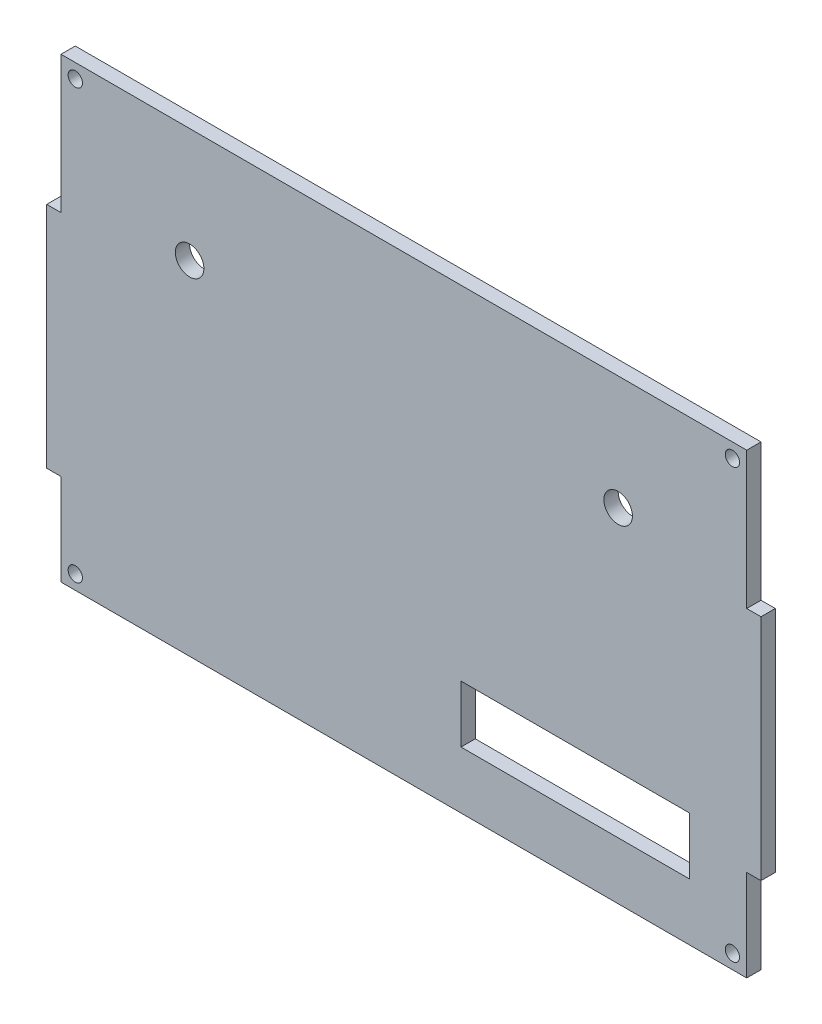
ISO-10303-21;
HEADER;
FILE_DESCRIPTION(('STEP AP214'),'2;1');
FILE_NAME('part.step','',(''),(''),'','','');
FILE_SCHEMA(('AUTOMOTIVE_DESIGN { 1 0 10303 214 1 1 1 1 }'));
ENDSEC;
DATA;
#1=APPLICATION_CONTEXT('core data for automotive mechanical design processes');
#2=APPLICATION_PROTOCOL_DEFINITION('international standard','automotive_design',2000,#1);
#3=PRODUCT_CONTEXT('',#1,'mechanical');
#4=PRODUCT('Part','Part','',(#3));
#5=PRODUCT_RELATED_PRODUCT_CATEGORY('part','',(#4));
#6=PRODUCT_DEFINITION_FORMATION('','',#4);
#7=PRODUCT_DEFINITION_CONTEXT('part definition',#1,'design');
#8=PRODUCT_DEFINITION('design','',#6,#7);
#9=PRODUCT_DEFINITION_SHAPE('','',#8);
#10=(LENGTH_UNIT() NAMED_UNIT(*) SI_UNIT(.MILLI.,.METRE.));
#11=(NAMED_UNIT(*) PLANE_ANGLE_UNIT() SI_UNIT($,.RADIAN.));
#12=(NAMED_UNIT(*) SI_UNIT($,.STERADIAN.) SOLID_ANGLE_UNIT());
#13=UNCERTAINTY_MEASURE_WITH_UNIT(LENGTH_MEASURE(1.E-05),#10,'distance_accuracy_value','');
#14=(GEOMETRIC_REPRESENTATION_CONTEXT(3) GLOBAL_UNCERTAINTY_ASSIGNED_CONTEXT((#13)) GLOBAL_UNIT_ASSIGNED_CONTEXT((#10,
#11,#12)) REPRESENTATION_CONTEXT('',''));
#15=CARTESIAN_POINT('',(0.,0.,0.));
#16=DIRECTION('',(0.,0.,1.));
#17=DIRECTION('',(1.,0.,0.));
#18=AXIS2_PLACEMENT_3D('',#15,#16,#17);
#19=CARTESIAN_POINT('',(-28.1520692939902,-11.4363190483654,3.175));
#20=DIRECTION('',(0.,0.,-1.));
#21=DIRECTION('',(-1.,0.,0.));
#22=AXIS2_PLACEMENT_3D('',#19,#20,#21);
#23=PLANE('',#22);
#24=CARTESIAN_POINT('',(0.422930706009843,-6.35631904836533,3.175));
#25=DIRECTION('',(0.,0.,1.));
#26=DIRECTION('',(1.,0.,0.));
#27=AXIS2_PLACEMENT_3D('',#24,#25,#26);
#28=CIRCLE('',#27,3.175);
#29=CARTESIAN_POINT('',(3.59793070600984,-6.35631904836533,3.175));
#30=VERTEX_POINT('',#29);
#31=EDGE_CURVE('E546',#30,#30,#28,.T.);
#32=ORIENTED_EDGE('',*,*,#31,.F.);
#33=EDGE_LOOP('',(#32));
#34=FACE_BOUND('',#33,.T.);
#35=CARTESIAN_POINT('',(121.07293070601,15.8686809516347,3.175));
#36=DIRECTION('',(0.,0.,1.));
#37=DIRECTION('',(1.,0.,0.));
#38=AXIS2_PLACEMENT_3D('',#35,#36,#37);
#39=CIRCLE('',#38,1.5875);
#40=CARTESIAN_POINT('',(122.66043070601,15.8686809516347,3.175));
#41=VERTEX_POINT('',#40);
#42=EDGE_CURVE('E558',#41,#41,#39,.T.);
#43=ORIENTED_EDGE('',*,*,#42,.F.);
#44=EDGE_LOOP('',(#43));
#45=FACE_BOUND('',#44,.T.);
#46=CARTESIAN_POINT('',(-24.9770692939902,-79.3813190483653,3.175));
#47=DIRECTION('',(0.,0.,1.));
#48=DIRECTION('',(1.,0.,0.));
#49=AXIS2_PLACEMENT_3D('',#46,#47,#48);
#50=CIRCLE('',#49,1.5875);
#51=CARTESIAN_POINT('',(-23.3895692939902,-79.3813190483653,3.175));
#52=VERTEX_POINT('',#51);
#53=EDGE_CURVE('E175',#52,#52,#50,.T.);
#54=ORIENTED_EDGE('',*,*,#53,.F.);
#55=EDGE_LOOP('',(#54));
#56=FACE_BOUND('',#55,.T.);
#57=DIRECTION('',(0.,-1.,0.));
#58=VECTOR('',#57,1.);
#59=CARTESIAN_POINT('',(-28.1520692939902,19.0436809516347,3.175));
#60=LINE('',#59,#58);
#61=CARTESIAN_POINT('',(-28.1520692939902,19.0436809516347,3.175));
#62=VERTEX_POINT('',#61);
#63=CARTESIAN_POINT('',(-28.1520692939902,-11.4363190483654,3.175));
#64=VERTEX_POINT('',#63);
#65=EDGE_CURVE('E185',#62,#64,#60,.T.);
#66=ORIENTED_EDGE('',*,*,#65,.T.);
#67=DIRECTION('',(-1.,0.,0.));
#68=VECTOR('',#67,1.);
#69=CARTESIAN_POINT('',(-28.1520692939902,-11.4363190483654,3.175));
#70=LINE('',#69,#68);
#71=CARTESIAN_POINT('',(-31.3270692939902,-11.4363190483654,3.175));
#72=VERTEX_POINT('',#71);
#73=EDGE_CURVE('E188',#64,#72,#70,.T.);
#74=ORIENTED_EDGE('',*,*,#73,.T.);
#75=DIRECTION('',(0.,-1.,0.));
#76=VECTOR('',#75,1.);
#77=CARTESIAN_POINT('',(-31.3270692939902,-11.4363190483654,3.175));
#78=LINE('',#77,#76);
#79=CARTESIAN_POINT('',(-31.3270692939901,-62.2363190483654,3.175));
#80=VERTEX_POINT('',#79);
#81=EDGE_CURVE('E191',#72,#80,#78,.T.);
#82=ORIENTED_EDGE('',*,*,#81,.T.);
#83=DIRECTION('',(1.,0.,0.));
#84=VECTOR('',#83,1.);
#85=CARTESIAN_POINT('',(-28.1520692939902,-62.2363190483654,3.175));
#86=LINE('',#85,#84);
#87=CARTESIAN_POINT('',(-28.1520692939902,-62.2363190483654,3.175));
#88=VERTEX_POINT('',#87);
#89=EDGE_CURVE('E193',#80,#88,#86,.T.);
#90=ORIENTED_EDGE('',*,*,#89,.T.);
#91=DIRECTION('',(0.,-1.,0.));
#92=VECTOR('',#91,1.);
#93=CARTESIAN_POINT('',(-28.1520692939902,-62.2363190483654,3.175));
#94=LINE('',#93,#92);
#95=CARTESIAN_POINT('',(-28.1520692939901,-82.5563190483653,3.175));
#96=VERTEX_POINT('',#95);
#97=EDGE_CURVE('E195',#88,#96,#94,.T.);
#98=ORIENTED_EDGE('',*,*,#97,.T.);
#99=DIRECTION('',(1.,0.,0.));
#100=VECTOR('',#99,1.);
#101=CARTESIAN_POINT('',(-28.1520692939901,-82.5563190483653,3.175));
#102=LINE('',#101,#100);
#103=CARTESIAN_POINT('',(124.24793070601,-82.5563190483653,3.175));
#104=VERTEX_POINT('',#103);
#105=EDGE_CURVE('E197',#96,#104,#102,.T.);
#106=ORIENTED_EDGE('',*,*,#105,.T.);
#107=DIRECTION('',(0.,1.,0.));
#108=VECTOR('',#107,1.);
#109=CARTESIAN_POINT('',(124.24793070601,-62.2363190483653,3.175));
#110=LINE('',#109,#108);
#111=CARTESIAN_POINT('',(124.24793070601,-62.2363190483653,3.175));
#112=VERTEX_POINT('',#111);
#113=EDGE_CURVE('E199',#104,#112,#110,.T.);
#114=ORIENTED_EDGE('',*,*,#113,.T.);
#115=DIRECTION('',(1.,0.,0.));
#116=VECTOR('',#115,1.);
#117=CARTESIAN_POINT('',(124.24793070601,-62.2363190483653,3.175));
#118=LINE('',#117,#116);
#119=CARTESIAN_POINT('',(127.42293070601,-62.2363190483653,3.175));
#120=VERTEX_POINT('',#119);
#121=EDGE_CURVE('E201',#112,#120,#118,.T.);
#122=ORIENTED_EDGE('',*,*,#121,.T.);
#123=DIRECTION('',(0.,1.,0.));
#124=VECTOR('',#123,1.);
#125=CARTESIAN_POINT('',(127.42293070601,-11.4363190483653,3.175));
#126=LINE('',#125,#124);
#127=CARTESIAN_POINT('',(127.42293070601,-11.4363190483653,3.175));
#128=VERTEX_POINT('',#127);
#129=EDGE_CURVE('E203',#120,#128,#126,.T.);
#130=ORIENTED_EDGE('',*,*,#129,.T.);
#131=DIRECTION('',(-1.,0.,0.));
#132=VECTOR('',#131,1.);
#133=CARTESIAN_POINT('',(124.24793070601,-11.4363190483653,3.175));
#134=LINE('',#133,#132);
#135=CARTESIAN_POINT('',(124.24793070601,-11.4363190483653,3.175));
#136=VERTEX_POINT('',#135);
#137=EDGE_CURVE('E205',#128,#136,#134,.T.);
#138=ORIENTED_EDGE('',*,*,#137,.T.);
#139=DIRECTION('',(0.,1.,0.));
#140=VECTOR('',#139,1.);
#141=CARTESIAN_POINT('',(124.24793070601,19.0436809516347,3.175));
#142=LINE('',#141,#140);
#143=CARTESIAN_POINT('',(124.24793070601,19.0436809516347,3.175));
#144=VERTEX_POINT('',#143);
#145=EDGE_CURVE('E207',#136,#144,#142,.T.);
#146=ORIENTED_EDGE('',*,*,#145,.T.);
#147=DIRECTION('',(-1.,0.,0.));
#148=VECTOR('',#147,1.);
#149=CARTESIAN_POINT('',(-28.1520692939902,19.0436809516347,3.175));
#150=LINE('',#149,#148);
#151=EDGE_CURVE('E209',#144,#62,#150,.T.);
#152=ORIENTED_EDGE('',*,*,#151,.T.);
#153=EDGE_LOOP('',(#66,#74,#82,#90,#98,#106,#114,#122,#130,#138,#146,#152));
#154=FACE_BOUND('',#153,.T.);
#155=DIRECTION('',(0.,-1.,0.));
#156=VECTOR('',#155,1.);
#157=CARTESIAN_POINT('',(60.7479307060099,-57.1563190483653,3.175));
#158=LINE('',#157,#156);
#159=CARTESIAN_POINT('',(60.7479307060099,-57.1563190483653,3.175));
#160=VERTEX_POINT('',#159);
#161=CARTESIAN_POINT('',(60.7479307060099,-69.8563190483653,3.175));
#162=VERTEX_POINT('',#161);
#163=EDGE_CURVE('E146',#160,#162,#158,.T.);
#164=ORIENTED_EDGE('',*,*,#163,.F.);
#165=DIRECTION('',(-1.,0.,0.));
#166=VECTOR('',#165,1.);
#167=CARTESIAN_POINT('',(60.7479307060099,-57.1563190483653,3.175));
#168=LINE('',#167,#166);
#169=CARTESIAN_POINT('',(111.54793070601,-57.1563190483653,3.175));
#170=VERTEX_POINT('',#169);
#171=EDGE_CURVE('E169',#170,#160,#168,.T.);
#172=ORIENTED_EDGE('',*,*,#171,.F.);
#173=DIRECTION('',(0.,1.,0.));
#174=VECTOR('',#173,1.);
#175=CARTESIAN_POINT('',(111.54793070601,-57.1563190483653,3.175));
#176=LINE('',#175,#174);
#177=CARTESIAN_POINT('',(111.54793070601,-69.8563190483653,3.175));
#178=VERTEX_POINT('',#177);
#179=EDGE_CURVE('E167',#178,#170,#176,.T.);
#180=ORIENTED_EDGE('',*,*,#179,.F.);
#181=DIRECTION('',(1.,0.,0.));
#182=VECTOR('',#181,1.);
#183=CARTESIAN_POINT('',(60.7479307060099,-69.8563190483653,3.175));
#184=LINE('',#183,#182);
#185=EDGE_CURVE('E154',#162,#178,#184,.T.);
#186=ORIENTED_EDGE('',*,*,#185,.F.);
#187=EDGE_LOOP('',(#164,#172,#180,#186));
#188=FACE_BOUND('',#187,.T.);
#189=CARTESIAN_POINT('',(-24.9770692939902,15.8686809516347,3.175));
#190=DIRECTION('',(0.,0.,1.));
#191=DIRECTION('',(1.,0.,0.));
#192=AXIS2_PLACEMENT_3D('',#189,#190,#191);
#193=CIRCLE('',#192,1.5875);
#194=CARTESIAN_POINT('',(-23.3895692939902,15.8686809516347,3.175));
#195=VERTEX_POINT('',#194);
#196=EDGE_CURVE('E564',#195,#195,#193,.T.);
#197=ORIENTED_EDGE('',*,*,#196,.F.);
#198=EDGE_LOOP('',(#197));
#199=FACE_BOUND('',#198,.T.);
#200=CARTESIAN_POINT('',(121.07293070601,-79.3813190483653,3.175));
#201=DIRECTION('',(0.,0.,1.));
#202=DIRECTION('',(1.,0.,0.));
#203=AXIS2_PLACEMENT_3D('',#200,#201,#202);
#204=CIRCLE('',#203,1.5875);
#205=CARTESIAN_POINT('',(122.66043070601,-79.3813190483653,3.175));
#206=VERTEX_POINT('',#205);
#207=EDGE_CURVE('E552',#206,#206,#204,.T.);
#208=ORIENTED_EDGE('',*,*,#207,.F.);
#209=EDGE_LOOP('',(#208));
#210=FACE_BOUND('',#209,.T.);
#211=CARTESIAN_POINT('',(95.6729307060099,-6.35631904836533,3.175));
#212=DIRECTION('',(0.,0.,1.));
#213=DIRECTION('',(1.,0.,0.));
#214=AXIS2_PLACEMENT_3D('',#211,#212,#213);
#215=CIRCLE('',#214,3.175);
#216=CARTESIAN_POINT('',(98.8479307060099,-6.35631904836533,3.175));
#217=VERTEX_POINT('',#216);
#218=EDGE_CURVE('E537',#217,#217,#215,.T.);
#219=ORIENTED_EDGE('',*,*,#218,.F.);
#220=EDGE_LOOP('',(#219));
#221=FACE_BOUND('',#220,.T.);
#222=ADVANCED_FACE('F33',(#34,#45,#56,#154,#188,#199,#210,#221),#23,.F.);
#223=CARTESIAN_POINT('',(-28.1520692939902,-11.4363190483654,0.));
#224=DIRECTION('',(0.,0.,-1.));
#225=DIRECTION('',(-1.,0.,0.));
#226=AXIS2_PLACEMENT_3D('',#223,#224,#225);
#227=PLANE('',#226);
#228=CARTESIAN_POINT('',(0.422930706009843,-6.35631904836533,0.));
#229=DIRECTION('',(0.,0.,1.));
#230=DIRECTION('',(1.,0.,0.));
#231=AXIS2_PLACEMENT_3D('',#228,#229,#230);
#232=CIRCLE('',#231,3.175);
#233=CARTESIAN_POINT('',(3.59793070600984,-6.35631904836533,0.));
#234=VERTEX_POINT('',#233);
#235=EDGE_CURVE('E543',#234,#234,#232,.T.);
#236=ORIENTED_EDGE('',*,*,#235,.T.);
#237=EDGE_LOOP('',(#236));
#238=FACE_BOUND('',#237,.T.);
#239=CARTESIAN_POINT('',(121.07293070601,15.8686809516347,0.));
#240=DIRECTION('',(0.,0.,1.));
#241=DIRECTION('',(1.,0.,0.));
#242=AXIS2_PLACEMENT_3D('',#239,#240,#241);
#243=CIRCLE('',#242,1.5875);
#244=CARTESIAN_POINT('',(122.66043070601,15.8686809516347,0.));
#245=VERTEX_POINT('',#244);
#246=EDGE_CURVE('E555',#245,#245,#243,.T.);
#247=ORIENTED_EDGE('',*,*,#246,.T.);
#248=EDGE_LOOP('',(#247));
#249=FACE_BOUND('',#248,.T.);
#250=CARTESIAN_POINT('',(-24.9770692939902,-79.3813190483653,0.));
#251=DIRECTION('',(0.,0.,1.));
#252=DIRECTION('',(1.,0.,0.));
#253=AXIS2_PLACEMENT_3D('',#250,#251,#252);
#254=CIRCLE('',#253,1.5875);
#255=CARTESIAN_POINT('',(-23.3895692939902,-79.3813190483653,0.));
#256=VERTEX_POINT('',#255);
#257=EDGE_CURVE('E567',#256,#256,#254,.T.);
#258=ORIENTED_EDGE('',*,*,#257,.T.);
#259=EDGE_LOOP('',(#258));
#260=FACE_BOUND('',#259,.T.);
#261=DIRECTION('',(0.,-1.,0.));
#262=VECTOR('',#261,1.);
#263=CARTESIAN_POINT('',(-28.1520692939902,19.0436809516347,0.));
#264=LINE('',#263,#262);
#265=CARTESIAN_POINT('',(-28.1520692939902,19.0436809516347,0.));
#266=VERTEX_POINT('',#265);
#267=CARTESIAN_POINT('',(-28.1520692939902,-11.4363190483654,0.));
#268=VERTEX_POINT('',#267);
#269=EDGE_CURVE('E162',#266,#268,#264,.T.);
#270=ORIENTED_EDGE('',*,*,#269,.F.);
#271=DIRECTION('',(-1.,0.,0.));
#272=VECTOR('',#271,1.);
#273=CARTESIAN_POINT('',(-28.1520692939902,19.0436809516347,0.));
#274=LINE('',#273,#272);
#275=CARTESIAN_POINT('',(124.24793070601,19.0436809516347,0.));
#276=VERTEX_POINT('',#275);
#277=EDGE_CURVE('E189',#276,#266,#274,.T.);
#278=ORIENTED_EDGE('',*,*,#277,.F.);
#279=DIRECTION('',(0.,1.,0.));
#280=VECTOR('',#279,1.);
#281=CARTESIAN_POINT('',(124.24793070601,19.0436809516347,0.));
#282=LINE('',#281,#280);
#283=CARTESIAN_POINT('',(124.24793070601,-11.4363190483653,0.));
#284=VERTEX_POINT('',#283);
#285=EDGE_CURVE('E232',#284,#276,#282,.T.);
#286=ORIENTED_EDGE('',*,*,#285,.F.);
#287=DIRECTION('',(-1.,0.,0.));
#288=VECTOR('',#287,1.);
#289=CARTESIAN_POINT('',(124.24793070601,-11.4363190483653,0.));
#290=LINE('',#289,#288);
#291=CARTESIAN_POINT('',(127.42293070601,-11.4363190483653,0.));
#292=VERTEX_POINT('',#291);
#293=EDGE_CURVE('E230',#292,#284,#290,.T.);
#294=ORIENTED_EDGE('',*,*,#293,.F.);
#295=DIRECTION('',(0.,1.,0.));
#296=VECTOR('',#295,1.);
#297=CARTESIAN_POINT('',(127.42293070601,-11.4363190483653,0.));
#298=LINE('',#297,#296);
#299=CARTESIAN_POINT('',(127.42293070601,-62.2363190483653,0.));
#300=VERTEX_POINT('',#299);
#301=EDGE_CURVE('E228',#300,#292,#298,.T.);
#302=ORIENTED_EDGE('',*,*,#301,.F.);
#303=DIRECTION('',(1.,0.,0.));
#304=VECTOR('',#303,1.);
#305=CARTESIAN_POINT('',(124.24793070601,-62.2363190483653,0.));
#306=LINE('',#305,#304);
#307=CARTESIAN_POINT('',(124.24793070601,-62.2363190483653,0.));
#308=VERTEX_POINT('',#307);
#309=EDGE_CURVE('E226',#308,#300,#306,.T.);
#310=ORIENTED_EDGE('',*,*,#309,.F.);
#311=DIRECTION('',(0.,1.,0.));
#312=VECTOR('',#311,1.);
#313=CARTESIAN_POINT('',(124.24793070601,-62.2363190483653,0.));
#314=LINE('',#313,#312);
#315=CARTESIAN_POINT('',(124.24793070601,-82.5563190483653,0.));
#316=VERTEX_POINT('',#315);
#317=EDGE_CURVE('E224',#316,#308,#314,.T.);
#318=ORIENTED_EDGE('',*,*,#317,.F.);
#319=DIRECTION('',(1.,0.,0.));
#320=VECTOR('',#319,1.);
#321=CARTESIAN_POINT('',(-28.1520692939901,-82.5563190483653,0.));
#322=LINE('',#321,#320);
#323=CARTESIAN_POINT('',(-28.1520692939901,-82.5563190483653,0.));
#324=VERTEX_POINT('',#323);
#325=EDGE_CURVE('E222',#324,#316,#322,.T.);
#326=ORIENTED_EDGE('',*,*,#325,.F.);
#327=DIRECTION('',(0.,-1.,0.));
#328=VECTOR('',#327,1.);
#329=CARTESIAN_POINT('',(-28.1520692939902,-62.2363190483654,0.));
#330=LINE('',#329,#328);
#331=CARTESIAN_POINT('',(-28.1520692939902,-62.2363190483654,0.));
#332=VERTEX_POINT('',#331);
#333=EDGE_CURVE('E220',#332,#324,#330,.T.);
#334=ORIENTED_EDGE('',*,*,#333,.F.);
#335=DIRECTION('',(1.,0.,0.));
#336=VECTOR('',#335,1.);
#337=CARTESIAN_POINT('',(-28.1520692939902,-62.2363190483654,0.));
#338=LINE('',#337,#336);
#339=CARTESIAN_POINT('',(-31.3270692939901,-62.2363190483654,0.));
#340=VERTEX_POINT('',#339);
#341=EDGE_CURVE('E218',#340,#332,#338,.T.);
#342=ORIENTED_EDGE('',*,*,#341,.F.);
#343=DIRECTION('',(0.,-1.,0.));
#344=VECTOR('',#343,1.);
#345=CARTESIAN_POINT('',(-31.3270692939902,-11.4363190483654,0.));
#346=LINE('',#345,#344);
#347=CARTESIAN_POINT('',(-31.3270692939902,-11.4363190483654,0.));
#348=VERTEX_POINT('',#347);
#349=EDGE_CURVE('E216',#348,#340,#346,.T.);
#350=ORIENTED_EDGE('',*,*,#349,.F.);
#351=DIRECTION('',(-1.,0.,0.));
#352=VECTOR('',#351,1.);
#353=CARTESIAN_POINT('',(-28.1520692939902,-11.4363190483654,0.));
#354=LINE('',#353,#352);
#355=EDGE_CURVE('E214',#268,#348,#354,.T.);
#356=ORIENTED_EDGE('',*,*,#355,.F.);
#357=EDGE_LOOP('',(#270,#278,#286,#294,#302,#310,#318,#326,#334,#342,#350,#356));
#358=FACE_BOUND('',#357,.T.);
#359=DIRECTION('',(-1.,0.,0.));
#360=VECTOR('',#359,1.);
#361=CARTESIAN_POINT('',(60.7479307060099,-57.1563190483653,0.));
#362=LINE('',#361,#360);
#363=CARTESIAN_POINT('',(111.54793070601,-57.1563190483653,0.));
#364=VERTEX_POINT('',#363);
#365=CARTESIAN_POINT('',(60.7479307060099,-57.1563190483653,0.));
#366=VERTEX_POINT('',#365);
#367=EDGE_CURVE('E155',#364,#366,#362,.T.);
#368=ORIENTED_EDGE('',*,*,#367,.T.);
#369=DIRECTION('',(0.,-1.,0.));
#370=VECTOR('',#369,1.);
#371=CARTESIAN_POINT('',(60.7479307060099,-57.1563190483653,0.));
#372=LINE('',#371,#370);
#373=CARTESIAN_POINT('',(60.7479307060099,-69.8563190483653,0.));
#374=VERTEX_POINT('',#373);
#375=EDGE_CURVE('E56',#366,#374,#372,.T.);
#376=ORIENTED_EDGE('',*,*,#375,.T.);
#377=DIRECTION('',(1.,0.,0.));
#378=VECTOR('',#377,1.);
#379=CARTESIAN_POINT('',(60.7479307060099,-69.8563190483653,0.));
#380=LINE('',#379,#378);
#381=CARTESIAN_POINT('',(111.54793070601,-69.8563190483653,0.));
#382=VERTEX_POINT('',#381);
#383=EDGE_CURVE('E161',#374,#382,#380,.T.);
#384=ORIENTED_EDGE('',*,*,#383,.T.);
#385=DIRECTION('',(0.,1.,0.));
#386=VECTOR('',#385,1.);
#387=CARTESIAN_POINT('',(111.54793070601,-57.1563190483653,0.));
#388=LINE('',#387,#386);
#389=EDGE_CURVE('E177',#382,#364,#388,.T.);
#390=ORIENTED_EDGE('',*,*,#389,.T.);
#391=EDGE_LOOP('',(#368,#376,#384,#390));
#392=FACE_BOUND('',#391,.T.);
#393=CARTESIAN_POINT('',(-24.9770692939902,15.8686809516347,0.));
#394=DIRECTION('',(0.,0.,1.));
#395=DIRECTION('',(1.,0.,0.));
#396=AXIS2_PLACEMENT_3D('',#393,#394,#395);
#397=CIRCLE('',#396,1.5875);
#398=CARTESIAN_POINT('',(-23.3895692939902,15.8686809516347,0.));
#399=VERTEX_POINT('',#398);
#400=EDGE_CURVE('E561',#399,#399,#397,.T.);
#401=ORIENTED_EDGE('',*,*,#400,.T.);
#402=EDGE_LOOP('',(#401));
#403=FACE_BOUND('',#402,.T.);
#404=CARTESIAN_POINT('',(121.07293070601,-79.3813190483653,0.));
#405=DIRECTION('',(0.,0.,1.));
#406=DIRECTION('',(1.,0.,0.));
#407=AXIS2_PLACEMENT_3D('',#404,#405,#406);
#408=CIRCLE('',#407,1.5875);
#409=CARTESIAN_POINT('',(122.66043070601,-79.3813190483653,0.));
#410=VERTEX_POINT('',#409);
#411=EDGE_CURVE('E549',#410,#410,#408,.T.);
#412=ORIENTED_EDGE('',*,*,#411,.T.);
#413=EDGE_LOOP('',(#412));
#414=FACE_BOUND('',#413,.T.);
#415=CARTESIAN_POINT('',(95.6729307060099,-6.35631904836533,0.));
#416=DIRECTION('',(0.,0.,1.));
#417=DIRECTION('',(1.,0.,0.));
#418=AXIS2_PLACEMENT_3D('',#415,#416,#417);
#419=CIRCLE('',#418,3.175);
#420=CARTESIAN_POINT('',(98.8479307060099,-6.35631904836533,0.));
#421=VERTEX_POINT('',#420);
#422=EDGE_CURVE('E540',#421,#421,#419,.T.);
#423=ORIENTED_EDGE('',*,*,#422,.T.);
#424=EDGE_LOOP('',(#423));
#425=FACE_BOUND('',#424,.T.);
#426=ADVANCED_FACE('F274',(#238,#249,#260,#358,#392,#403,#414,#425),#227,.T.);
#427=CARTESIAN_POINT('',(-28.1520692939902,19.0436809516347,3.175));
#428=DIRECTION('',(1.,0.,0.));
#429=DIRECTION('',(0.,1.,0.));
#430=AXIS2_PLACEMENT_3D('',#427,#428,#429);
#431=PLANE('',#430);
#432=ORIENTED_EDGE('',*,*,#269,.T.);
#433=DIRECTION('',(0.,0.,-1.));
#434=VECTOR('',#433,1.);
#435=CARTESIAN_POINT('',(-28.1520692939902,-11.4363190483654,3.175));
#436=LINE('',#435,#434);
#437=EDGE_CURVE('E11',#64,#268,#436,.T.);
#438=ORIENTED_EDGE('',*,*,#437,.F.);
#439=ORIENTED_EDGE('',*,*,#65,.F.);
#440=DIRECTION('',(0.,0.,-1.));
#441=VECTOR('',#440,1.);
#442=CARTESIAN_POINT('',(-28.1520692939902,19.0436809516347,3.175));
#443=LINE('',#442,#441);
#444=EDGE_CURVE('E211',#62,#266,#443,.T.);
#445=ORIENTED_EDGE('',*,*,#444,.T.);
#446=EDGE_LOOP('',(#432,#438,#439,#445));
#447=FACE_BOUND('',#446,.T.);
#448=ADVANCED_FACE('F35',(#447),#431,.F.);
#449=CARTESIAN_POINT('',(-28.1520692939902,-11.4363190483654,3.175));
#450=DIRECTION('',(0.,-1.,0.));
#451=DIRECTION('',(0.,0.,-1.));
#452=AXIS2_PLACEMENT_3D('',#449,#450,#451);
#453=PLANE('',#452);
#454=ORIENTED_EDGE('',*,*,#355,.T.);
#455=DIRECTION('',(0.,0.,-1.));
#456=VECTOR('',#455,1.);
#457=CARTESIAN_POINT('',(-31.3270692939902,-11.4363190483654,3.175));
#458=LINE('',#457,#456);
#459=EDGE_CURVE('E41',#72,#348,#458,.T.);
#460=ORIENTED_EDGE('',*,*,#459,.F.);
#461=ORIENTED_EDGE('',*,*,#73,.F.);
#462=ORIENTED_EDGE('',*,*,#437,.T.);
#463=EDGE_LOOP('',(#454,#460,#461,#462));
#464=FACE_BOUND('',#463,.T.);
#465=ADVANCED_FACE('F291',(#464),#453,.F.);
#466=CARTESIAN_POINT('',(-31.3270692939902,-11.4363190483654,3.175));
#467=DIRECTION('',(1.,0.,0.));
#468=DIRECTION('',(0.,1.,0.));
#469=AXIS2_PLACEMENT_3D('',#466,#467,#468);
#470=PLANE('',#469);
#471=ORIENTED_EDGE('',*,*,#349,.T.);
#472=DIRECTION('',(0.,0.,-1.));
#473=VECTOR('',#472,1.);
#474=CARTESIAN_POINT('',(-31.3270692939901,-62.2363190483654,3.175));
#475=LINE('',#474,#473);
#476=EDGE_CURVE('E261',#80,#340,#475,.T.);
#477=ORIENTED_EDGE('',*,*,#476,.F.);
#478=ORIENTED_EDGE('',*,*,#81,.F.);
#479=ORIENTED_EDGE('',*,*,#459,.T.);
#480=EDGE_LOOP('',(#471,#477,#478,#479));
#481=FACE_BOUND('',#480,.T.);
#482=ADVANCED_FACE('F268',(#481),#470,.F.);
#483=CARTESIAN_POINT('',(-28.1520692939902,-62.2363190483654,3.175));
#484=DIRECTION('',(0.,1.,0.));
#485=DIRECTION('',(0.,0.,1.));
#486=AXIS2_PLACEMENT_3D('',#483,#484,#485);
#487=PLANE('',#486);
#488=ORIENTED_EDGE('',*,*,#341,.T.);
#489=DIRECTION('',(0.,0.,-1.));
#490=VECTOR('',#489,1.);
#491=CARTESIAN_POINT('',(-28.1520692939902,-62.2363190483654,3.175));
#492=LINE('',#491,#490);
#493=EDGE_CURVE('E258',#88,#332,#492,.T.);
#494=ORIENTED_EDGE('',*,*,#493,.F.);
#495=ORIENTED_EDGE('',*,*,#89,.F.);
#496=ORIENTED_EDGE('',*,*,#476,.T.);
#497=EDGE_LOOP('',(#488,#494,#495,#496));
#498=FACE_BOUND('',#497,.T.);
#499=ADVANCED_FACE('F280',(#498),#487,.F.);
#500=CARTESIAN_POINT('',(-28.1520692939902,-62.2363190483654,3.175));
#501=DIRECTION('',(1.,0.,0.));
#502=DIRECTION('',(0.,1.,0.));
#503=AXIS2_PLACEMENT_3D('',#500,#501,#502);
#504=PLANE('',#503);
#505=ORIENTED_EDGE('',*,*,#333,.T.);
#506=DIRECTION('',(0.,0.,-1.));
#507=VECTOR('',#506,1.);
#508=CARTESIAN_POINT('',(-28.1520692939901,-82.5563190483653,3.175));
#509=LINE('',#508,#507);
#510=EDGE_CURVE('E255',#96,#324,#509,.T.);
#511=ORIENTED_EDGE('',*,*,#510,.F.);
#512=ORIENTED_EDGE('',*,*,#97,.F.);
#513=ORIENTED_EDGE('',*,*,#493,.T.);
#514=EDGE_LOOP('',(#505,#511,#512,#513));
#515=FACE_BOUND('',#514,.T.);
#516=ADVANCED_FACE('F284',(#515),#504,.F.);
#517=CARTESIAN_POINT('',(-28.1520692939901,-82.5563190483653,3.175));
#518=DIRECTION('',(0.,1.,0.));
#519=DIRECTION('',(-1.,0.,0.));
#520=AXIS2_PLACEMENT_3D('',#517,#518,#519);
#521=PLANE('',#520);
#522=ORIENTED_EDGE('',*,*,#325,.T.);
#523=DIRECTION('',(0.,0.,-1.));
#524=VECTOR('',#523,1.);
#525=CARTESIAN_POINT('',(124.24793070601,-82.5563190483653,3.175));
#526=LINE('',#525,#524);
#527=EDGE_CURVE('E252',#104,#316,#526,.T.);
#528=ORIENTED_EDGE('',*,*,#527,.F.);
#529=ORIENTED_EDGE('',*,*,#105,.F.);
#530=ORIENTED_EDGE('',*,*,#510,.T.);
#531=EDGE_LOOP('',(#522,#528,#529,#530));
#532=FACE_BOUND('',#531,.T.);
#533=ADVANCED_FACE('F324',(#532),#521,.F.);
#534=CARTESIAN_POINT('',(124.24793070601,-62.2363190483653,3.175));
#535=DIRECTION('',(-1.,0.,0.));
#536=DIRECTION('',(0.,-1.,0.));
#537=AXIS2_PLACEMENT_3D('',#534,#535,#536);
#538=PLANE('',#537);
#539=ORIENTED_EDGE('',*,*,#317,.T.);
#540=DIRECTION('',(0.,0.,-1.));
#541=VECTOR('',#540,1.);
#542=CARTESIAN_POINT('',(124.24793070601,-62.2363190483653,3.175));
#543=LINE('',#542,#541);
#544=EDGE_CURVE('E249',#112,#308,#543,.T.);
#545=ORIENTED_EDGE('',*,*,#544,.F.);
#546=ORIENTED_EDGE('',*,*,#113,.F.);
#547=ORIENTED_EDGE('',*,*,#527,.T.);
#548=EDGE_LOOP('',(#539,#545,#546,#547));
#549=FACE_BOUND('',#548,.T.);
#550=ADVANCED_FACE('F322',(#549),#538,.F.);
#551=CARTESIAN_POINT('',(124.24793070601,-62.2363190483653,3.175));
#552=DIRECTION('',(0.,1.,0.));
#553=DIRECTION('',(0.,0.,1.));
#554=AXIS2_PLACEMENT_3D('',#551,#552,#553);
#555=PLANE('',#554);
#556=ORIENTED_EDGE('',*,*,#309,.T.);
#557=DIRECTION('',(0.,0.,-1.));
#558=VECTOR('',#557,1.);
#559=CARTESIAN_POINT('',(127.42293070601,-62.2363190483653,3.175));
#560=LINE('',#559,#558);
#561=EDGE_CURVE('E246',#120,#300,#560,.T.);
#562=ORIENTED_EDGE('',*,*,#561,.F.);
#563=ORIENTED_EDGE('',*,*,#121,.F.);
#564=ORIENTED_EDGE('',*,*,#544,.T.);
#565=EDGE_LOOP('',(#556,#562,#563,#564));
#566=FACE_BOUND('',#565,.T.);
#567=ADVANCED_FACE('F318',(#566),#555,.F.);
#568=CARTESIAN_POINT('',(127.42293070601,-11.4363190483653,3.175));
#569=DIRECTION('',(-1.,0.,0.));
#570=DIRECTION('',(0.,-1.,0.));
#571=AXIS2_PLACEMENT_3D('',#568,#569,#570);
#572=PLANE('',#571);
#573=ORIENTED_EDGE('',*,*,#301,.T.);
#574=DIRECTION('',(0.,0.,-1.));
#575=VECTOR('',#574,1.);
#576=CARTESIAN_POINT('',(127.42293070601,-11.4363190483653,3.175));
#577=LINE('',#576,#575);
#578=EDGE_CURVE('E243',#128,#292,#577,.T.);
#579=ORIENTED_EDGE('',*,*,#578,.F.);
#580=ORIENTED_EDGE('',*,*,#129,.F.);
#581=ORIENTED_EDGE('',*,*,#561,.T.);
#582=EDGE_LOOP('',(#573,#579,#580,#581));
#583=FACE_BOUND('',#582,.T.);
#584=ADVANCED_FACE('F313',(#583),#572,.F.);
#585=CARTESIAN_POINT('',(124.24793070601,-11.4363190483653,3.175));
#586=DIRECTION('',(0.,-1.,0.));
#587=DIRECTION('',(0.,0.,-1.));
#588=AXIS2_PLACEMENT_3D('',#585,#586,#587);
#589=PLANE('',#588);
#590=ORIENTED_EDGE('',*,*,#293,.T.);
#591=DIRECTION('',(0.,0.,-1.));
#592=VECTOR('',#591,1.);
#593=CARTESIAN_POINT('',(124.24793070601,-11.4363190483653,3.175));
#594=LINE('',#593,#592);
#595=EDGE_CURVE('E240',#136,#284,#594,.T.);
#596=ORIENTED_EDGE('',*,*,#595,.F.);
#597=ORIENTED_EDGE('',*,*,#137,.F.);
#598=ORIENTED_EDGE('',*,*,#578,.T.);
#599=EDGE_LOOP('',(#590,#596,#597,#598));
#600=FACE_BOUND('',#599,.T.);
#601=ADVANCED_FACE('F307',(#600),#589,.F.);
#602=CARTESIAN_POINT('',(124.24793070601,19.0436809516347,3.175));
#603=DIRECTION('',(-1.,0.,0.));
#604=DIRECTION('',(0.,-1.,0.));
#605=AXIS2_PLACEMENT_3D('',#602,#603,#604);
#606=PLANE('',#605);
#607=ORIENTED_EDGE('',*,*,#285,.T.);
#608=DIRECTION('',(0.,0.,-1.));
#609=VECTOR('',#608,1.);
#610=CARTESIAN_POINT('',(124.24793070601,19.0436809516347,3.175));
#611=LINE('',#610,#609);
#612=EDGE_CURVE('E237',#144,#276,#611,.T.);
#613=ORIENTED_EDGE('',*,*,#612,.F.);
#614=ORIENTED_EDGE('',*,*,#145,.F.);
#615=ORIENTED_EDGE('',*,*,#595,.T.);
#616=EDGE_LOOP('',(#607,#613,#614,#615));
#617=FACE_BOUND('',#616,.T.);
#618=ADVANCED_FACE('F303',(#617),#606,.F.);
#619=CARTESIAN_POINT('',(-28.1520692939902,19.0436809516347,3.175));
#620=DIRECTION('',(0.,-1.,0.));
#621=DIRECTION('',(1.,0.,0.));
#622=AXIS2_PLACEMENT_3D('',#619,#620,#621);
#623=PLANE('',#622);
#624=ORIENTED_EDGE('',*,*,#277,.T.);
#625=ORIENTED_EDGE('',*,*,#444,.F.);
#626=ORIENTED_EDGE('',*,*,#151,.F.);
#627=ORIENTED_EDGE('',*,*,#612,.T.);
#628=EDGE_LOOP('',(#624,#625,#626,#627));
#629=FACE_BOUND('',#628,.T.);
#630=ADVANCED_FACE('F298',(#629),#623,.F.);
#631=CARTESIAN_POINT('',(60.7479307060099,-57.1563190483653,3.175));
#632=DIRECTION('',(1.,0.,0.));
#633=DIRECTION('',(0.,1.,0.));
#634=AXIS2_PLACEMENT_3D('',#631,#632,#633);
#635=PLANE('',#634);
#636=ORIENTED_EDGE('',*,*,#375,.F.);
#637=DIRECTION('',(0.,0.,-1.));
#638=VECTOR('',#637,1.);
#639=CARTESIAN_POINT('',(60.7479307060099,-57.1563190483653,3.175));
#640=LINE('',#639,#638);
#641=EDGE_CURVE('E150',#160,#366,#640,.T.);
#642=ORIENTED_EDGE('',*,*,#641,.F.);
#643=ORIENTED_EDGE('',*,*,#163,.T.);
#644=DIRECTION('',(0.,0.,-1.));
#645=VECTOR('',#644,1.);
#646=CARTESIAN_POINT('',(60.7479307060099,-69.8563190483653,3.175));
#647=LINE('',#646,#645);
#648=EDGE_CURVE('E149',#162,#374,#647,.T.);
#649=ORIENTED_EDGE('',*,*,#648,.T.);
#650=EDGE_LOOP('',(#636,#642,#643,#649));
#651=FACE_BOUND('',#650,.T.);
#652=ADVANCED_FACE('F148',(#651),#635,.T.);
#653=CARTESIAN_POINT('',(60.7479307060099,-69.8563190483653,3.175));
#654=DIRECTION('',(0.,1.,0.));
#655=DIRECTION('',(0.,0.,1.));
#656=AXIS2_PLACEMENT_3D('',#653,#654,#655);
#657=PLANE('',#656);
#658=ORIENTED_EDGE('',*,*,#383,.F.);
#659=ORIENTED_EDGE('',*,*,#648,.F.);
#660=ORIENTED_EDGE('',*,*,#185,.T.);
#661=DIRECTION('',(0.,0.,-1.));
#662=VECTOR('',#661,1.);
#663=CARTESIAN_POINT('',(111.54793070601,-69.8563190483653,3.175));
#664=LINE('',#663,#662);
#665=EDGE_CURVE('E163',#178,#382,#664,.T.);
#666=ORIENTED_EDGE('',*,*,#665,.T.);
#667=EDGE_LOOP('',(#658,#659,#660,#666));
#668=FACE_BOUND('',#667,.T.);
#669=ADVANCED_FACE('F158',(#668),#657,.T.);
#670=CARTESIAN_POINT('',(111.54793070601,-57.1563190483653,3.175));
#671=DIRECTION('',(-1.,0.,0.));
#672=DIRECTION('',(0.,0.,1.));
#673=AXIS2_PLACEMENT_3D('',#670,#671,#672);
#674=PLANE('',#673);
#675=ORIENTED_EDGE('',*,*,#389,.F.);
#676=ORIENTED_EDGE('',*,*,#665,.F.);
#677=ORIENTED_EDGE('',*,*,#179,.T.);
#678=DIRECTION('',(0.,0.,-1.));
#679=VECTOR('',#678,1.);
#680=CARTESIAN_POINT('',(111.54793070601,-57.1563190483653,3.175));
#681=LINE('',#680,#679);
#682=EDGE_CURVE('E48',#170,#364,#681,.T.);
#683=ORIENTED_EDGE('',*,*,#682,.T.);
#684=EDGE_LOOP('',(#675,#676,#677,#683));
#685=FACE_BOUND('',#684,.T.);
#686=ADVANCED_FACE('F386',(#685),#674,.T.);
#687=CARTESIAN_POINT('',(60.7479307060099,-57.1563190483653,3.175));
#688=DIRECTION('',(0.,-1.,0.));
#689=DIRECTION('',(1.,0.,0.));
#690=AXIS2_PLACEMENT_3D('',#687,#688,#689);
#691=PLANE('',#690);
#692=ORIENTED_EDGE('',*,*,#367,.F.);
#693=ORIENTED_EDGE('',*,*,#682,.F.);
#694=ORIENTED_EDGE('',*,*,#171,.T.);
#695=ORIENTED_EDGE('',*,*,#641,.T.);
#696=EDGE_LOOP('',(#692,#693,#694,#695));
#697=FACE_BOUND('',#696,.T.);
#698=ADVANCED_FACE('F392',(#697),#691,.T.);
#699=CARTESIAN_POINT('',(-24.9770692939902,-79.3813190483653,3.175));
#700=DIRECTION('',(0.,0.,-1.));
#701=DIRECTION('',(-1.,0.,0.));
#702=AXIS2_PLACEMENT_3D('',#699,#700,#701);
#703=CYLINDRICAL_SURFACE('',#702,1.5875);
#704=ORIENTED_EDGE('',*,*,#53,.T.);
#705=EDGE_LOOP('',(#704));
#706=FACE_BOUND('',#705,.T.);
#707=ORIENTED_EDGE('',*,*,#257,.F.);
#708=EDGE_LOOP('',(#707));
#709=FACE_BOUND('',#708,.T.);
#710=ADVANCED_FACE('F400',(#706,#709),#703,.F.);
#711=CARTESIAN_POINT('',(-24.9770692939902,15.8686809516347,3.175));
#712=DIRECTION('',(0.,0.,-1.));
#713=DIRECTION('',(-1.,0.,0.));
#714=AXIS2_PLACEMENT_3D('',#711,#712,#713);
#715=CYLINDRICAL_SURFACE('',#714,1.5875);
#716=ORIENTED_EDGE('',*,*,#196,.T.);
#717=EDGE_LOOP('',(#716));
#718=FACE_BOUND('',#717,.T.);
#719=ORIENTED_EDGE('',*,*,#400,.F.);
#720=EDGE_LOOP('',(#719));
#721=FACE_BOUND('',#720,.T.);
#722=ADVANCED_FACE('F407',(#718,#721),#715,.F.);
#723=CARTESIAN_POINT('',(121.07293070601,15.8686809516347,3.175));
#724=DIRECTION('',(0.,0.,-1.));
#725=DIRECTION('',(-1.,0.,0.));
#726=AXIS2_PLACEMENT_3D('',#723,#724,#725);
#727=CYLINDRICAL_SURFACE('',#726,1.5875);
#728=ORIENTED_EDGE('',*,*,#42,.T.);
#729=EDGE_LOOP('',(#728));
#730=FACE_BOUND('',#729,.T.);
#731=ORIENTED_EDGE('',*,*,#246,.F.);
#732=EDGE_LOOP('',(#731));
#733=FACE_BOUND('',#732,.T.);
#734=ADVANCED_FACE('F415',(#730,#733),#727,.F.);
#735=CARTESIAN_POINT('',(121.07293070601,-79.3813190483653,3.175));
#736=DIRECTION('',(0.,0.,-1.));
#737=DIRECTION('',(-1.,0.,0.));
#738=AXIS2_PLACEMENT_3D('',#735,#736,#737);
#739=CYLINDRICAL_SURFACE('',#738,1.5875);
#740=ORIENTED_EDGE('',*,*,#207,.T.);
#741=EDGE_LOOP('',(#740));
#742=FACE_BOUND('',#741,.T.);
#743=ORIENTED_EDGE('',*,*,#411,.F.);
#744=EDGE_LOOP('',(#743));
#745=FACE_BOUND('',#744,.T.);
#746=ADVANCED_FACE('F423',(#742,#745),#739,.F.);
#747=CARTESIAN_POINT('',(0.422930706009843,-6.35631904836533,3.175));
#748=DIRECTION('',(0.,0.,-1.));
#749=DIRECTION('',(-1.,0.,0.));
#750=AXIS2_PLACEMENT_3D('',#747,#748,#749);
#751=CYLINDRICAL_SURFACE('',#750,3.175);
#752=ORIENTED_EDGE('',*,*,#31,.T.);
#753=EDGE_LOOP('',(#752));
#754=FACE_BOUND('',#753,.T.);
#755=ORIENTED_EDGE('',*,*,#235,.F.);
#756=EDGE_LOOP('',(#755));
#757=FACE_BOUND('',#756,.T.);
#758=ADVANCED_FACE('F431',(#754,#757),#751,.F.);
#759=CARTESIAN_POINT('',(95.6729307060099,-6.35631904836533,3.175));
#760=DIRECTION('',(0.,0.,-1.));
#761=DIRECTION('',(-1.,0.,0.));
#762=AXIS2_PLACEMENT_3D('',#759,#760,#761);
#763=CYLINDRICAL_SURFACE('',#762,3.175);
#764=ORIENTED_EDGE('',*,*,#218,.T.);
#765=EDGE_LOOP('',(#764));
#766=FACE_BOUND('',#765,.T.);
#767=ORIENTED_EDGE('',*,*,#422,.F.);
#768=EDGE_LOOP('',(#767));
#769=FACE_BOUND('',#768,.T.);
#770=ADVANCED_FACE('F439',(#766,#769),#763,.F.);
#771=CLOSED_SHELL('',(#222,#426,#448,#465,#482,#499,#516,#533,#550,#567,#584,#601,#618,#630,
#652,#669,#686,#698,#710,#722,#734,#746,#758,#770));
#772=MANIFOLD_SOLID_BREP('B2',#771);
#773=ADVANCED_BREP_SHAPE_REPRESENTATION('',(#18,#772),#14);
#774=SHAPE_DEFINITION_REPRESENTATION(#9,#773);
ENDSEC;
END-ISO-10303-21;
